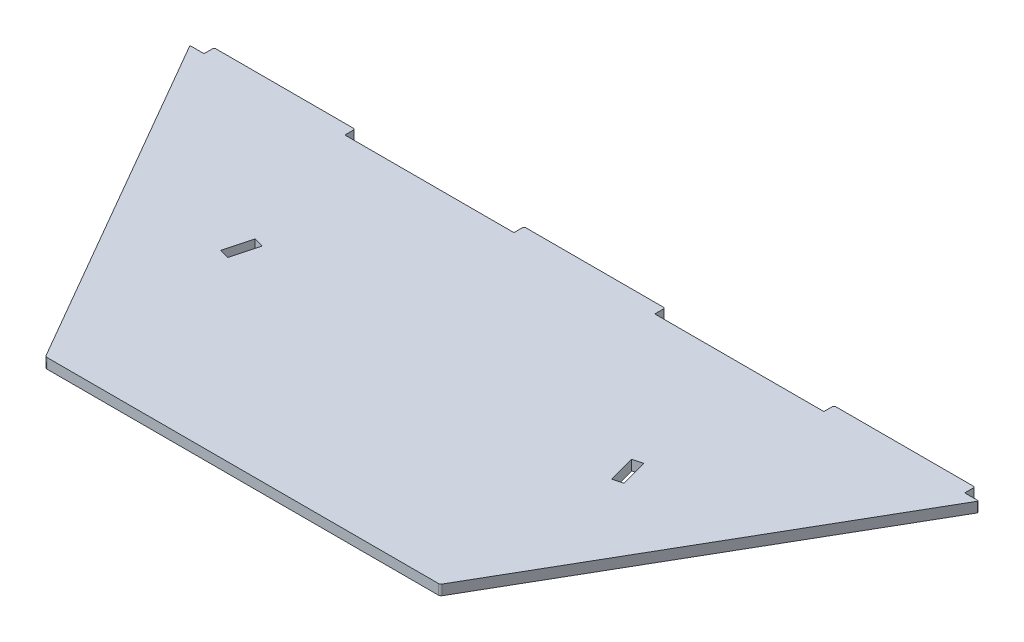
from build123d import *
from OCP.BRepFilletAPI import BRepFilletAPI_MakeChamfer

# Parameters (mm, degrees)
SALIENTE_EXTRUIR1_DEPTH = 18
CROQUIS2_W              = 1400
CROQUIS2_H              = 606.217782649
CORTAR_EXTRUIR1_DEPTH   = 927.187885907
CROQUIS3_W              = 250
CROQUIS3_H              = 18
SALIENTE_EXTRUIR2_DEPTH = 18
CORTAR_EXTRUIR2_DEPTH   = 927.187885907
REDONDEO1_R             = 5
CHAFL_N1_SIZE           = 2
CHAFL_N1_SIZE2          = 1.464101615


with BuildPart() as part:
    # Croquis1 → Saliente-Extruir1 (new body)
    with BuildSketch(Plane(origin=(0, 0, 0), x_dir=(1, 0, 0), z_dir=(0, 1, 0))):
        Polygon((350, 606.217782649), (-350, 606.217782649), (-700, 0), (-350, -606.217782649), (350, -606.217782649), (700, 0), align=None)
    extrude(amount=SALIENTE_EXTRUIR1_DEPTH)

    # Croquis2 → Cortar-Extruir1 (cut, through all)
    with BuildSketch(Plane(origin=(0, 18, 0), x_dir=(1, 0, 0), z_dir=(0, 1, 0))):
        with Locations((0, 303.108891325)):
            Rectangle(CROQUIS2_W, CROQUIS2_H)
    extrude(amount=-CORTAR_EXTRUIR1_DEPTH, mode=Mode.SUBTRACT)

    # Croquis3 → Saliente-Extruir2 (add, through all)
    with BuildSketch(Plane(origin=(0, 18, 0), x_dir=(1, 0, 0), z_dir=(0, 1, 0))):
        with Locations((-550, 9)):
            Rectangle(CROQUIS3_W, CROQUIS3_H)
        with Locations((0, 9)):
            Rectangle(CROQUIS3_W, CROQUIS3_H)
        with Locations((550, 9)):
            Rectangle(CROQUIS3_W, CROQUIS3_H)
    extrude(amount=-SALIENTE_EXTRUIR2_DEPTH)

    # Croquis4 → Cortar-Extruir2 (cut, through all)
    with BuildSketch(Plane.XZ):
        Polygon((345.109101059, 239.170701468), (327.722436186, 243.82944428), (340.663388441, 292.125735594), (358.050053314, 287.466992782), align=None)
        Polygon((-358.050053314, 287.466992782), (-345.109101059, 239.170701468), (-327.722436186, 243.82944428), (-340.663388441, 292.125735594), align=None)
    extrude(amount=-CORTAR_EXTRUIR2_DEPTH, mode=Mode.SUBTRACT)

    # Redondeo1
    redondeo1_edges = [part.edges().sort_by_distance(p)[0] for p in [
        (350, 9, 606.217782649),
        (-350, 9, 606.217782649),
    ]]
    fillet(redondeo1_edges, radius=REDONDEO1_R)

    # Chafl_n1: one chamfer whose edges measure the first distance from different faces: ONE call of the kernel's chamfer builder (chamfer() names one face for all edges)
    chafl_n1_edges_1 = [part.edges().sort_by_distance(p)[0] for p in [
        (700, 9, 0),
    ]]
    chafl_n1_side_1 = [part.faces().sort_by_distance(p)[0] for p in [
        (525.721687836, 9, 301.858891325),
    ]]
    chafl_n1_edges_2 = [part.edges().sort_by_distance(p)[0] for p in [
        (-700, 9, 0),
    ]]
    chafl_n1_side_2 = [part.faces().sort_by_distance(p)[0] for p in [
        (-687.5, 9, 0),
    ]]
    chafl_n1_edges_3 = [part.edges().sort_by_distance(p)[0] for p in [
        (-675, 9, -18),
        (-425, 9, -18),
        (-125, 9, -18),
        (125, 9, -18),
        (425, 9, -18),
        (675, 9, -18),
    ]]
    chafl_n1 = BRepFilletAPI_MakeChamfer(part.part.solid().wrapped)
    for e in chafl_n1_edges_1:
        chafl_n1.Add(CHAFL_N1_SIZE, CHAFL_N1_SIZE2, e.wrapped, chafl_n1_side_1[0].wrapped)  # the first distance lies on this face
    for e in chafl_n1_edges_2:
        chafl_n1.Add(CHAFL_N1_SIZE, CHAFL_N1_SIZE2, e.wrapped, chafl_n1_side_2[0].wrapped)  # the first distance lies on this face
    for e in chafl_n1_edges_3:
        chafl_n1.Add(CHAFL_N1_SIZE, e.wrapped)
    add(Compound.cast(chafl_n1.Shape()), mode=Mode.REPLACE)


solid = part.part
